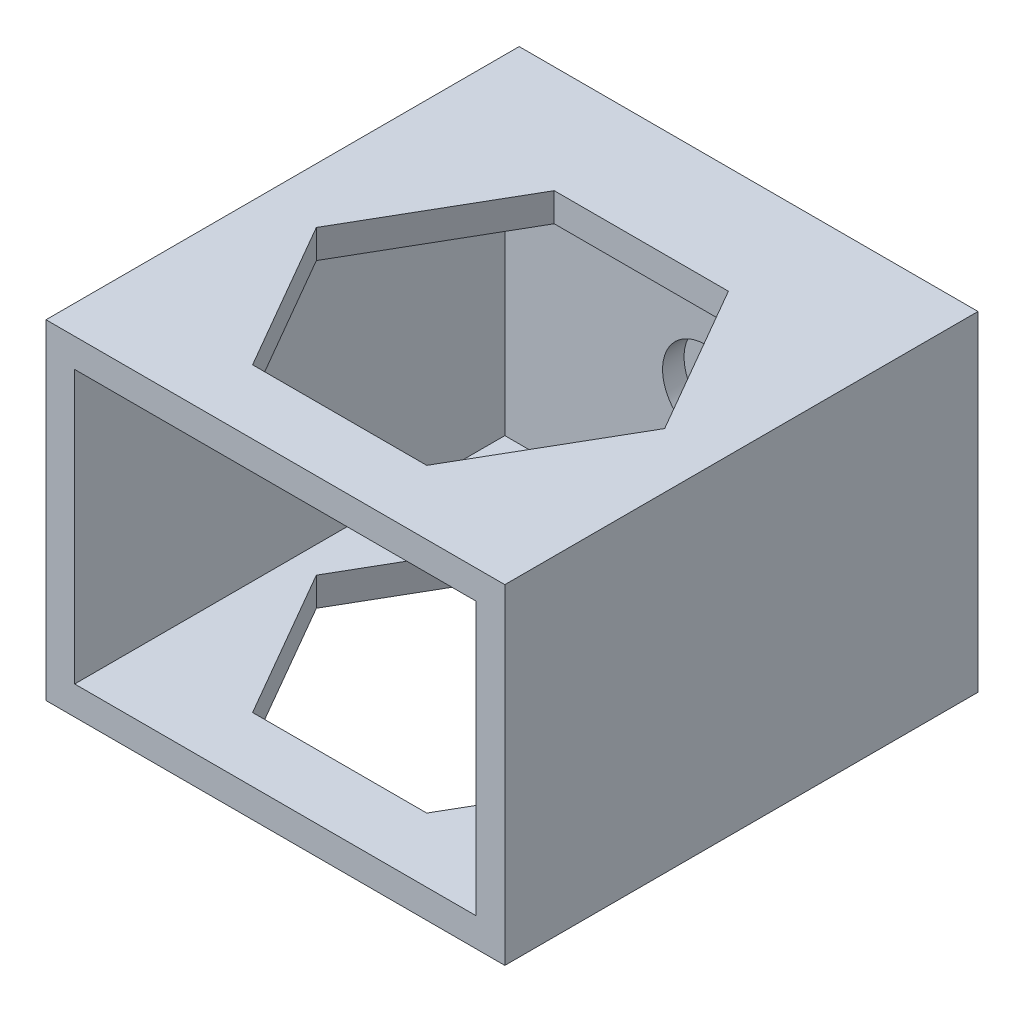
from build123d import *

# Parameters (mm, degrees)
ESBO_O1_W                = 32
ESBO_O1_H                = 23
ESBO_O1_R                = 1.5
RESSALTO_EXTRUS_O1_DEPTH = 3
CORTE_EXTRUS_O1_START    = -1.5
ESBO_O2_R                = 3
ESBO_O2_R_2              = 1.5
CORTE_EXTRUS_O1_DEPTH    = 1.5
ESBO_O3_W                = 32
ESBO_O3_H                = 23
ESBO_O3_W_2              = 28
ESBO_O3_H_2              = 19
RESSALTO_EXTRUS_O2_DEPTH = 30
CORTE_EXTRUS_O2_DEPTH    = 30


with BuildPart() as part:
    # Esbo_o1 → Ressalto-extrus_o1 (new body)
    with BuildSketch(Plane.XY):
        with Locations((-7.918154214, 6.898601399)):
            Rectangle(ESBO_O1_W, ESBO_O1_H)
        with Locations((-7.918154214, 6.898601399)):
            Circle(ESBO_O1_R, mode=Mode.SUBTRACT)
    extrude(amount=RESSALTO_EXTRUS_O1_DEPTH)

    # Esbo_o2 → Corte-extrus_o1 (cut)
    with BuildSketch(Plane.XY.offset(3).offset(CORTE_EXTRUS_O1_START)):
        with Locations((-7.918154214, 6.898601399)):
            Circle(ESBO_O2_R)
        with Locations((-7.918154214, 6.898601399)):
            Circle(ESBO_O2_R_2, mode=Mode.SUBTRACT)
    extrude(amount=CORTE_EXTRUS_O1_DEPTH, mode=Mode.SUBTRACT)

    # Esbo_o3 → Ressalto-extrus_o2 (add)
    with BuildSketch(Plane.XY.offset(3)):
        with Locations((-7.918154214, 6.898601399)):
            Rectangle(ESBO_O3_W, ESBO_O3_H)
        with Locations((-7.918154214, 6.898601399)):
            Rectangle(ESBO_O3_W_2, ESBO_O3_H_2, mode=Mode.SUBTRACT)
    extrude(amount=RESSALTO_EXTRUS_O2_DEPTH)

    # Esbo_o4 → Corte-extrus_o2 (cut)
    with BuildSketch(Plane.XZ.offset(4.601398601)):
        Polygon((-20.06460454, 18), (-13.991379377, 7.480865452), (-1.844929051, 7.480865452), (4.228296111, 18), (-1.844929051, 28.519134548), (-13.991379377, 28.519134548), align=None)
    extrude(amount=-CORTE_EXTRUS_O2_DEPTH, mode=Mode.SUBTRACT)


solid = part.part
